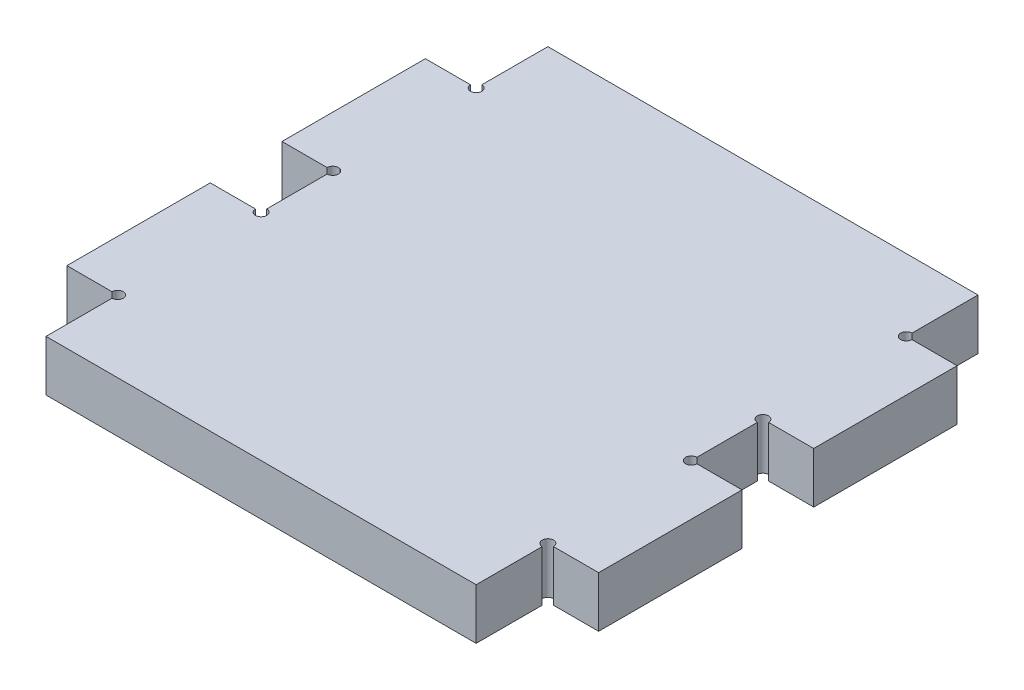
from build123d import *

# Parameters (mm, degrees)
BOSS_EXTRUDE2_DEPTH = 4.5


with BuildPart() as part:
    # Sketch1 → Boss-Extrude2 (new body)
    with BuildSketch(Plane(origin=(0, 0, 0), x_dir=(1, 0, 0), z_dir=(0, 1, 0))):
        with BuildLine():
            Line((0, 5.85), (0, 0))
            Line((0, 0), (38.1, 0))
            Line((38.1, 0), (38.1, 5.85))
            ThreePointArc((38.1, 5.85), (37.746446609, 6.703553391), (38.6, 6.35))
            Line((38.6, 6.35), (42.6, 6.35))
            Line((42.6, 6.35), (42.6, 19.05))
            Line((42.6, 19.05), (38.6, 19.05))
            ThreePointArc((38.6, 19.05), (37.746446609, 18.696446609), (38.1, 19.55))
            Line((38.1, 19.55), (38.1, 24.9))
            ThreePointArc((38.1, 24.9), (37.746446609, 25.753553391), (38.6, 25.4))
            Line((38.6, 25.4), (42.6, 25.4))
            Line((42.6, 25.4), (42.6, 38.1))
            Line((42.6, 38.1), (38.6, 38.1))
            ThreePointArc((38.6, 38.1), (37.746446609, 37.746446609), (38.1, 38.6))
            Line((38.1, 38.6), (38.1, 44.45))
            Line((38.1, 44.45), (0, 44.45))
            Line((0, 44.45), (0, 38.6))
            ThreePointArc((0, 38.6), (0.353553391, 37.746446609), (-0.5, 38.1))
            Line((-0.5, 38.1), (-4.5, 38.1))
            Line((-4.5, 38.1), (-4.5, 25.4))
            Line((-4.5, 25.4), (-0.5, 25.4))
            ThreePointArc((-0.5, 25.4), (0.353553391, 25.753553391), (0, 24.9))
            Line((0, 24.9), (0, 19.55))
            ThreePointArc((0, 19.55), (0.353553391, 18.696446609), (-0.5, 19.05))
            Line((-0.5, 19.05), (-4.5, 19.05))
            Line((-4.5, 19.05), (-4.5, 6.35))
            Line((-4.5, 6.35), (-0.5, 6.35))
            ThreePointArc((-0.5, 6.35), (0.353553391, 6.703553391), (0, 5.85))
        make_face()
    extrude(amount=BOSS_EXTRUDE2_DEPTH)


solid = part.part
